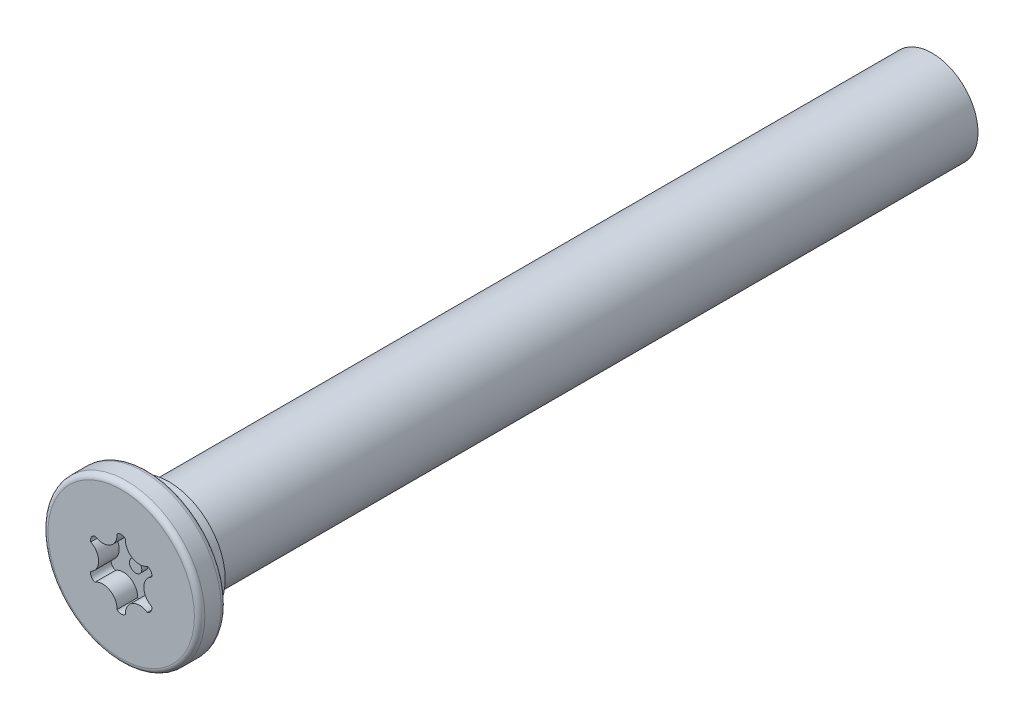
ISO-10303-21;
HEADER;
FILE_DESCRIPTION(('STEP AP214'),'2;1');
FILE_NAME('part.step','',(''),(''),'','','');
FILE_SCHEMA(('AUTOMOTIVE_DESIGN { 1 0 10303 214 1 1 1 1 }'));
ENDSEC;
DATA;
#1=APPLICATION_CONTEXT('core data for automotive mechanical design processes');
#2=APPLICATION_PROTOCOL_DEFINITION('international standard','automotive_design',2000,#1);
#3=PRODUCT_CONTEXT('',#1,'mechanical');
#4=PRODUCT('Part','Part','',(#3));
#5=PRODUCT_RELATED_PRODUCT_CATEGORY('part','',(#4));
#6=PRODUCT_DEFINITION_FORMATION('','',#4);
#7=PRODUCT_DEFINITION_CONTEXT('part definition',#1,'design');
#8=PRODUCT_DEFINITION('design','',#6,#7);
#9=PRODUCT_DEFINITION_SHAPE('','',#8);
#10=(LENGTH_UNIT() NAMED_UNIT(*) SI_UNIT(.MILLI.,.METRE.));
#11=(NAMED_UNIT(*) PLANE_ANGLE_UNIT() SI_UNIT($,.RADIAN.));
#12=(NAMED_UNIT(*) SI_UNIT($,.STERADIAN.) SOLID_ANGLE_UNIT());
#13=UNCERTAINTY_MEASURE_WITH_UNIT(LENGTH_MEASURE(1.E-05),#10,'distance_accuracy_value','');
#14=(GEOMETRIC_REPRESENTATION_CONTEXT(3) GLOBAL_UNCERTAINTY_ASSIGNED_CONTEXT((#13)) GLOBAL_UNIT_ASSIGNED_CONTEXT((#10,
#11,#12)) REPRESENTATION_CONTEXT('',''));
#15=CARTESIAN_POINT('',(0.,0.,0.));
#16=DIRECTION('',(0.,0.,1.));
#17=DIRECTION('',(1.,0.,0.));
#18=AXIS2_PLACEMENT_3D('',#15,#16,#17);
#19=CARTESIAN_POINT('',(0.,0.,0.));
#20=DIRECTION('',(0.,0.,1.));
#21=DIRECTION('',(1.,0.,0.));
#22=AXIS2_PLACEMENT_3D('',#19,#20,#21);
#23=PLANE('',#22);
#24=CARTESIAN_POINT('',(0.,0.,0.));
#25=DIRECTION('',(0.,0.,1.));
#26=DIRECTION('',(1.,0.,0.));
#27=AXIS2_PLACEMENT_3D('',#24,#25,#26);
#28=CIRCLE('',#27,3.55599999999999);
#29=CARTESIAN_POINT('',(3.55599999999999,0.,0.));
#30=VERTEX_POINT('',#29);
#31=EDGE_CURVE('E54',#30,#30,#28,.T.);
#32=ORIENTED_EDGE('',*,*,#31,.T.);
#33=EDGE_LOOP('',(#32));
#34=FACE_BOUND('',#33,.T.);
#35=CARTESIAN_POINT('',(0.893828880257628,1.54815703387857,0.));
#36=DIRECTION('',(0.,0.,1.));
#37=DIRECTION('',(1.,0.,0.));
#38=AXIS2_PLACEMENT_3D('',#35,#36,#37);
#39=CIRCLE('',#38,0.69);
#40=CARTESIAN_POINT('',(0.205060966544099,1.58937306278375,0.));
#41=VERTEX_POINT('',#40);
#42=CARTESIAN_POINT('',(1.27390696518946,0.972274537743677,0.));
#43=VERTEX_POINT('',#42);
#44=EDGE_CURVE('E181',#41,#43,#39,.T.);
#45=ORIENTED_EDGE('',*,*,#44,.T.);
#46=CARTESIAN_POINT('',(1.19884944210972,0.692156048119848,0.));
#47=DIRECTION('',(0.,0.,1.));
#48=DIRECTION('',(1.,0.,0.));
#49=AXIS2_PLACEMENT_3D('',#46,#47,#48);
#50=CIRCLE('',#49,0.29);
#51=CARTESIAN_POINT('',(1.47896793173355,0.617098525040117,0.));
#52=VERTEX_POINT('',#51);
#53=EDGE_CURVE('E61',#43,#52,#50,.F.);
#54=ORIENTED_EDGE('',*,*,#53,.T.);
#55=CARTESIAN_POINT('',(1.78765776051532,0.,0.));
#56=DIRECTION('',(0.,0.,1.));
#57=DIRECTION('',(1.,0.,0.));
#58=AXIS2_PLACEMENT_3D('',#55,#56,#57);
#59=CIRCLE('',#58,0.69);
#60=CARTESIAN_POINT('',(1.47896793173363,-0.617098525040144,0.));
#61=VERTEX_POINT('',#60);
#62=EDGE_CURVE('E111',#52,#61,#59,.T.);
#63=ORIENTED_EDGE('',*,*,#62,.T.);
#64=CARTESIAN_POINT('',(1.1988494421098,-0.692156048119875,0.));
#65=DIRECTION('',(0.,0.,1.));
#66=DIRECTION('',(1.,0.,0.));
#67=AXIS2_PLACEMENT_3D('',#64,#65,#66);
#68=CIRCLE('',#67,0.29);
#69=CARTESIAN_POINT('',(1.27390696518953,-0.972274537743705,0.));
#70=VERTEX_POINT('',#69);
#71=EDGE_CURVE('E216',#61,#70,#68,.F.);
#72=ORIENTED_EDGE('',*,*,#71,.T.);
#73=CARTESIAN_POINT('',(0.893828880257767,-1.54815703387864,0.));
#74=DIRECTION('',(0.,0.,1.));
#75=DIRECTION('',(1.,0.,0.));
#76=AXIS2_PLACEMENT_3D('',#73,#74,#75);
#77=CIRCLE('',#76,0.69);
#78=CARTESIAN_POINT('',(0.205060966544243,-1.5893730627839,0.));
#79=VERTEX_POINT('',#78);
#80=EDGE_CURVE('E160',#70,#79,#77,.T.);
#81=ORIENTED_EDGE('',*,*,#80,.T.);
#82=CARTESIAN_POINT('',(1.43067375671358E-13,-1.3843120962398,0.));
#83=DIRECTION('',(0.,0.,1.));
#84=DIRECTION('',(1.,0.,0.));
#85=AXIS2_PLACEMENT_3D('',#82,#83,#84);
#86=CIRCLE('',#85,0.29);
#87=CARTESIAN_POINT('',(-0.205060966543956,-1.5893730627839,0.));
#88=VERTEX_POINT('',#87);
#89=EDGE_CURVE('E210',#79,#88,#86,.F.);
#90=ORIENTED_EDGE('',*,*,#89,.T.);
#91=CARTESIAN_POINT('',(-0.893828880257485,-1.54815703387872,0.));
#92=DIRECTION('',(0.,0.,1.));
#93=DIRECTION('',(1.,0.,0.));
#94=AXIS2_PLACEMENT_3D('',#91,#92,#93);
#95=CIRCLE('',#94,0.69);
#96=CARTESIAN_POINT('',(-1.27390696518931,-0.97227453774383,0.));
#97=VERTEX_POINT('',#96);
#98=EDGE_CURVE('E206',#88,#97,#95,.T.);
#99=ORIENTED_EDGE('',*,*,#98,.T.);
#100=CARTESIAN_POINT('',(-1.19884944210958,-0.69215604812,0.));
#101=DIRECTION('',(0.,0.,1.));
#102=DIRECTION('',(1.,0.,0.));
#103=AXIS2_PLACEMENT_3D('',#100,#101,#102);
#104=CIRCLE('',#103,0.29);
#105=CARTESIAN_POINT('',(-1.47896793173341,-0.617098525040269,0.));
#106=VERTEX_POINT('',#105);
#107=EDGE_CURVE('E202',#97,#106,#104,.F.);
#108=ORIENTED_EDGE('',*,*,#107,.T.);
#109=CARTESIAN_POINT('',(-1.78765776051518,-1.56674837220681E-13,0.));
#110=DIRECTION('',(0.,0.,1.));
#111=DIRECTION('',(1.,0.,0.));
#112=AXIS2_PLACEMENT_3D('',#109,#110,#111);
#113=CIRCLE('',#112,0.69);
#114=CARTESIAN_POINT('',(-1.47896793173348,0.617098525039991,0.));
#115=VERTEX_POINT('',#114);
#116=EDGE_CURVE('E198',#106,#115,#113,.T.);
#117=ORIENTED_EDGE('',*,*,#116,.T.);
#118=CARTESIAN_POINT('',(-1.19884944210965,0.692156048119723,0.));
#119=DIRECTION('',(0.,0.,1.));
#120=DIRECTION('',(1.,0.,0.));
#121=AXIS2_PLACEMENT_3D('',#118,#119,#120);
#122=CIRCLE('',#121,0.29);
#123=CARTESIAN_POINT('',(-1.27390696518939,0.972274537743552,0.));
#124=VERTEX_POINT('',#123);
#125=EDGE_CURVE('E194',#115,#124,#122,.F.);
#126=ORIENTED_EDGE('',*,*,#125,.T.);
#127=CARTESIAN_POINT('',(-0.893828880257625,1.54815703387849,0.));
#128=DIRECTION('',(0.,0.,1.));
#129=DIRECTION('',(1.,0.,0.));
#130=AXIS2_PLACEMENT_3D('',#127,#128,#129);
#131=CIRCLE('',#130,0.690000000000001);
#132=CARTESIAN_POINT('',(-0.205060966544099,1.58937306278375,0.));
#133=VERTEX_POINT('',#132);
#134=EDGE_CURVE('E190',#124,#133,#131,.T.);
#135=ORIENTED_EDGE('',*,*,#134,.T.);
#136=CARTESIAN_POINT('',(0.,1.38431209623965,0.));
#137=DIRECTION('',(0.,0.,1.));
#138=DIRECTION('',(1.,0.,0.));
#139=AXIS2_PLACEMENT_3D('',#136,#137,#138);
#140=CIRCLE('',#139,0.29);
#141=EDGE_CURVE('E186',#133,#41,#140,.F.);
#142=ORIENTED_EDGE('',*,*,#141,.T.);
#143=EDGE_LOOP('',(#45,#54,#63,#72,#81,#90,#99,#108,#117,#126,#135,#142));
#144=FACE_BOUND('',#143,.T.);
#145=ADVANCED_FACE('F45',(#34,#144),#23,.T.);
#146=CARTESIAN_POINT('',(0.,0.,-1.3));
#147=DIRECTION('',(0.,0.,1.));
#148=DIRECTION('',(1.,0.,0.));
#149=AXIS2_PLACEMENT_3D('',#146,#147,#148);
#150=PLANE('',#149);
#151=CARTESIAN_POINT('',(0.,0.,-1.3));
#152=DIRECTION('',(0.,0.,1.));
#153=DIRECTION('',(1.,0.,0.));
#154=AXIS2_PLACEMENT_3D('',#151,#152,#153);
#155=CIRCLE('',#154,2.738000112);
#156=CARTESIAN_POINT('',(2.738000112,0.,-1.3));
#157=VERTEX_POINT('',#156);
#158=EDGE_CURVE('E11',#157,#157,#155,.F.);
#159=ORIENTED_EDGE('',*,*,#158,.F.);
#160=EDGE_LOOP('',(#159));
#161=FACE_BOUND('',#160,.T.);
#162=CARTESIAN_POINT('',(0.,0.,-1.3));
#163=DIRECTION('',(0.,0.,1.));
#164=DIRECTION('',(1.,0.,0.));
#165=AXIS2_PLACEMENT_3D('',#162,#163,#164);
#166=CIRCLE('',#165,3.55599999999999);
#167=CARTESIAN_POINT('',(3.55599999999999,0.,-1.3));
#168=VERTEX_POINT('',#167);
#169=EDGE_CURVE('E260',#168,#168,#166,.F.);
#170=ORIENTED_EDGE('',*,*,#169,.T.);
#171=EDGE_LOOP('',(#170));
#172=FACE_BOUND('',#171,.T.);
#173=ADVANCED_FACE('F283',(#161,#172),#150,.F.);
#174=CARTESIAN_POINT('',(0.,0.,-1.3));
#175=DIRECTION('',(0.,0.,1.));
#176=DIRECTION('',(1.,0.,0.));
#177=AXIS2_PLACEMENT_3D('',#174,#175,#176);
#178=CYLINDRICAL_SURFACE('',#177,3.80999999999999);
#179=CARTESIAN_POINT('',(0.,0.,-1.046));
#180=DIRECTION('',(0.,0.,1.));
#181=DIRECTION('',(1.,0.,0.));
#182=AXIS2_PLACEMENT_3D('',#179,#180,#181);
#183=CIRCLE('',#182,3.80999999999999);
#184=CARTESIAN_POINT('',(3.80999999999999,0.,-1.046));
#185=VERTEX_POINT('',#184);
#186=EDGE_CURVE('E256',#185,#185,#183,.T.);
#187=ORIENTED_EDGE('',*,*,#186,.T.);
#188=EDGE_LOOP('',(#187));
#189=FACE_BOUND('',#188,.T.);
#190=CARTESIAN_POINT('',(0.,0.,-0.254));
#191=DIRECTION('',(0.,0.,1.));
#192=DIRECTION('',(1.,0.,0.));
#193=AXIS2_PLACEMENT_3D('',#190,#191,#192);
#194=CIRCLE('',#193,3.80999999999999);
#195=CARTESIAN_POINT('',(3.80999999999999,0.,-0.254));
#196=VERTEX_POINT('',#195);
#197=EDGE_CURVE('E225',#196,#196,#194,.F.);
#198=ORIENTED_EDGE('',*,*,#197,.T.);
#199=EDGE_LOOP('',(#198));
#200=FACE_BOUND('',#199,.T.);
#201=ADVANCED_FACE('F289',(#189,#200),#178,.T.);
#202=CARTESIAN_POINT('',(1.19884944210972,0.692156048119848,-1.));
#203=DIRECTION('',(0.,0.,1.));
#204=DIRECTION('',(1.,0.,0.));
#205=AXIS2_PLACEMENT_3D('',#202,#203,#204);
#206=CYLINDRICAL_SURFACE('',#205,0.29);
#207=ORIENTED_EDGE('',*,*,#53,.F.);
#208=DIRECTION('',(0.,0.,1.));
#209=VECTOR('',#208,1.);
#210=CARTESIAN_POINT('',(1.27390696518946,0.972274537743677,-1.));
#211=LINE('',#210,#209);
#212=CARTESIAN_POINT('',(1.27390696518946,0.972274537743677,-1.));
#213=VERTEX_POINT('',#212);
#214=EDGE_CURVE('E178',#213,#43,#211,.T.);
#215=ORIENTED_EDGE('',*,*,#214,.F.);
#216=CARTESIAN_POINT('',(1.19884944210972,0.692156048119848,-1.));
#217=DIRECTION('',(0.,0.,1.));
#218=DIRECTION('',(1.,0.,0.));
#219=AXIS2_PLACEMENT_3D('',#216,#217,#218);
#220=CIRCLE('',#219,0.29);
#221=CARTESIAN_POINT('',(1.47896793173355,0.617098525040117,-1.));
#222=VERTEX_POINT('',#221);
#223=EDGE_CURVE('E221',#213,#222,#220,.F.);
#224=ORIENTED_EDGE('',*,*,#223,.T.);
#225=DIRECTION('',(0.,0.,1.));
#226=VECTOR('',#225,1.);
#227=CARTESIAN_POINT('',(1.47896793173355,0.617098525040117,-1.));
#228=LINE('',#227,#226);
#229=EDGE_CURVE('E222',#222,#52,#228,.T.);
#230=ORIENTED_EDGE('',*,*,#229,.T.);
#231=EDGE_LOOP('',(#207,#215,#224,#230));
#232=FACE_BOUND('',#231,.T.);
#233=ADVANCED_FACE('F294',(#232),#206,.F.);
#234=CARTESIAN_POINT('',(1.78765776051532,0.,-1.));
#235=DIRECTION('',(0.,0.,1.));
#236=DIRECTION('',(1.,0.,0.));
#237=AXIS2_PLACEMENT_3D('',#234,#235,#236);
#238=CYLINDRICAL_SURFACE('',#237,0.69);
#239=ORIENTED_EDGE('',*,*,#62,.F.);
#240=ORIENTED_EDGE('',*,*,#229,.F.);
#241=CARTESIAN_POINT('',(1.78765776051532,0.,-1.));
#242=DIRECTION('',(0.,0.,1.));
#243=DIRECTION('',(1.,0.,0.));
#244=AXIS2_PLACEMENT_3D('',#241,#242,#243);
#245=CIRCLE('',#244,0.69);
#246=CARTESIAN_POINT('',(1.47896793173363,-0.617098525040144,-1.));
#247=VERTEX_POINT('',#246);
#248=EDGE_CURVE('E70',#222,#247,#245,.T.);
#249=ORIENTED_EDGE('',*,*,#248,.T.);
#250=DIRECTION('',(0.,0.,1.));
#251=VECTOR('',#250,1.);
#252=CARTESIAN_POINT('',(1.47896793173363,-0.617098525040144,-1.));
#253=LINE('',#252,#251);
#254=EDGE_CURVE('E151',#247,#61,#253,.T.);
#255=ORIENTED_EDGE('',*,*,#254,.T.);
#256=EDGE_LOOP('',(#239,#240,#249,#255));
#257=FACE_BOUND('',#256,.T.);
#258=ADVANCED_FACE('F301',(#257),#238,.T.);
#259=CARTESIAN_POINT('',(1.1988494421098,-0.692156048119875,-1.));
#260=DIRECTION('',(0.,0.,1.));
#261=DIRECTION('',(1.,0.,0.));
#262=AXIS2_PLACEMENT_3D('',#259,#260,#261);
#263=CYLINDRICAL_SURFACE('',#262,0.29);
#264=ORIENTED_EDGE('',*,*,#71,.F.);
#265=ORIENTED_EDGE('',*,*,#254,.F.);
#266=CARTESIAN_POINT('',(1.1988494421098,-0.692156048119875,-1.));
#267=DIRECTION('',(0.,0.,1.));
#268=DIRECTION('',(1.,0.,0.));
#269=AXIS2_PLACEMENT_3D('',#266,#267,#268);
#270=CIRCLE('',#269,0.29);
#271=CARTESIAN_POINT('',(1.27390696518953,-0.972274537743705,-1.));
#272=VERTEX_POINT('',#271);
#273=EDGE_CURVE('E145',#247,#272,#270,.F.);
#274=ORIENTED_EDGE('',*,*,#273,.T.);
#275=DIRECTION('',(0.,0.,1.));
#276=VECTOR('',#275,1.);
#277=CARTESIAN_POINT('',(1.27390696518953,-0.972274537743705,-1.));
#278=LINE('',#277,#276);
#279=EDGE_CURVE('E149',#272,#70,#278,.T.);
#280=ORIENTED_EDGE('',*,*,#279,.T.);
#281=EDGE_LOOP('',(#264,#265,#274,#280));
#282=FACE_BOUND('',#281,.T.);
#283=ADVANCED_FACE('F148',(#282),#263,.F.);
#284=CARTESIAN_POINT('',(0.893828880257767,-1.54815703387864,-1.));
#285=DIRECTION('',(0.,0.,1.));
#286=DIRECTION('',(1.,0.,0.));
#287=AXIS2_PLACEMENT_3D('',#284,#285,#286);
#288=CYLINDRICAL_SURFACE('',#287,0.69);
#289=ORIENTED_EDGE('',*,*,#80,.F.);
#290=ORIENTED_EDGE('',*,*,#279,.F.);
#291=CARTESIAN_POINT('',(0.893828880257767,-1.54815703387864,-1.));
#292=DIRECTION('',(0.,0.,1.));
#293=DIRECTION('',(1.,0.,0.));
#294=AXIS2_PLACEMENT_3D('',#291,#292,#293);
#295=CIRCLE('',#294,0.69);
#296=CARTESIAN_POINT('',(0.205060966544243,-1.5893730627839,-1.));
#297=VERTEX_POINT('',#296);
#298=EDGE_CURVE('E154',#272,#297,#295,.T.);
#299=ORIENTED_EDGE('',*,*,#298,.T.);
#300=DIRECTION('',(0.,0.,1.));
#301=VECTOR('',#300,1.);
#302=CARTESIAN_POINT('',(0.205060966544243,-1.5893730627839,-1.));
#303=LINE('',#302,#301);
#304=EDGE_CURVE('E163',#297,#79,#303,.T.);
#305=ORIENTED_EDGE('',*,*,#304,.T.);
#306=EDGE_LOOP('',(#289,#290,#299,#305));
#307=FACE_BOUND('',#306,.T.);
#308=ADVANCED_FACE('F157',(#307),#288,.T.);
#309=CARTESIAN_POINT('',(1.43067375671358E-13,-1.3843120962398,-1.));
#310=DIRECTION('',(0.,0.,1.));
#311=DIRECTION('',(1.,0.,0.));
#312=AXIS2_PLACEMENT_3D('',#309,#310,#311);
#313=CYLINDRICAL_SURFACE('',#312,0.29);
#314=ORIENTED_EDGE('',*,*,#89,.F.);
#315=ORIENTED_EDGE('',*,*,#304,.F.);
#316=CARTESIAN_POINT('',(1.43067375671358E-13,-1.3843120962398,-1.));
#317=DIRECTION('',(0.,0.,1.));
#318=DIRECTION('',(1.,0.,0.));
#319=AXIS2_PLACEMENT_3D('',#316,#317,#318);
#320=CIRCLE('',#319,0.29);
#321=CARTESIAN_POINT('',(-0.205060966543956,-1.5893730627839,-1.));
#322=VERTEX_POINT('',#321);
#323=EDGE_CURVE('E168',#297,#322,#320,.F.);
#324=ORIENTED_EDGE('',*,*,#323,.T.);
#325=DIRECTION('',(0.,0.,1.));
#326=VECTOR('',#325,1.);
#327=CARTESIAN_POINT('',(-0.205060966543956,-1.5893730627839,-1.));
#328=LINE('',#327,#326);
#329=EDGE_CURVE('E230',#322,#88,#328,.T.);
#330=ORIENTED_EDGE('',*,*,#329,.T.);
#331=EDGE_LOOP('',(#314,#315,#324,#330));
#332=FACE_BOUND('',#331,.T.);
#333=ADVANCED_FACE('F318',(#332),#313,.F.);
#334=CARTESIAN_POINT('',(-0.893828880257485,-1.54815703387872,-1.));
#335=DIRECTION('',(0.,0.,1.));
#336=DIRECTION('',(1.,0.,0.));
#337=AXIS2_PLACEMENT_3D('',#334,#335,#336);
#338=CYLINDRICAL_SURFACE('',#337,0.69);
#339=ORIENTED_EDGE('',*,*,#98,.F.);
#340=ORIENTED_EDGE('',*,*,#329,.F.);
#341=CARTESIAN_POINT('',(-0.893828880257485,-1.54815703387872,-1.));
#342=DIRECTION('',(0.,0.,1.));
#343=DIRECTION('',(1.,0.,0.));
#344=AXIS2_PLACEMENT_3D('',#341,#342,#343);
#345=CIRCLE('',#344,0.69);
#346=CARTESIAN_POINT('',(-1.27390696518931,-0.97227453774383,-1.));
#347=VERTEX_POINT('',#346);
#348=EDGE_CURVE('E172',#322,#347,#345,.T.);
#349=ORIENTED_EDGE('',*,*,#348,.T.);
#350=DIRECTION('',(0.,0.,1.));
#351=VECTOR('',#350,1.);
#352=CARTESIAN_POINT('',(-1.27390696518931,-0.97227453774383,-1.));
#353=LINE('',#352,#351);
#354=EDGE_CURVE('E233',#347,#97,#353,.T.);
#355=ORIENTED_EDGE('',*,*,#354,.T.);
#356=EDGE_LOOP('',(#339,#340,#349,#355));
#357=FACE_BOUND('',#356,.T.);
#358=ADVANCED_FACE('F321',(#357),#338,.T.);
#359=CARTESIAN_POINT('',(-1.19884944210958,-0.69215604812,-1.));
#360=DIRECTION('',(0.,0.,1.));
#361=DIRECTION('',(1.,0.,0.));
#362=AXIS2_PLACEMENT_3D('',#359,#360,#361);
#363=CYLINDRICAL_SURFACE('',#362,0.29);
#364=ORIENTED_EDGE('',*,*,#107,.F.);
#365=ORIENTED_EDGE('',*,*,#354,.F.);
#366=CARTESIAN_POINT('',(-1.19884944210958,-0.69215604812,-1.));
#367=DIRECTION('',(0.,0.,1.));
#368=DIRECTION('',(1.,0.,0.));
#369=AXIS2_PLACEMENT_3D('',#366,#367,#368);
#370=CIRCLE('',#369,0.29);
#371=CARTESIAN_POINT('',(-1.47896793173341,-0.617098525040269,-1.));
#372=VERTEX_POINT('',#371);
#373=EDGE_CURVE('E374',#347,#372,#370,.F.);
#374=ORIENTED_EDGE('',*,*,#373,.T.);
#375=DIRECTION('',(0.,0.,1.));
#376=VECTOR('',#375,1.);
#377=CARTESIAN_POINT('',(-1.47896793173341,-0.617098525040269,-1.));
#378=LINE('',#377,#376);
#379=EDGE_CURVE('E236',#372,#106,#378,.T.);
#380=ORIENTED_EDGE('',*,*,#379,.T.);
#381=EDGE_LOOP('',(#364,#365,#374,#380));
#382=FACE_BOUND('',#381,.T.);
#383=ADVANCED_FACE('F325',(#382),#363,.F.);
#384=CARTESIAN_POINT('',(-1.78765776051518,-1.56674837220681E-13,-1.));
#385=DIRECTION('',(0.,0.,1.));
#386=DIRECTION('',(1.,0.,0.));
#387=AXIS2_PLACEMENT_3D('',#384,#385,#386);
#388=CYLINDRICAL_SURFACE('',#387,0.69);
#389=ORIENTED_EDGE('',*,*,#116,.F.);
#390=ORIENTED_EDGE('',*,*,#379,.F.);
#391=CARTESIAN_POINT('',(-1.78765776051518,-1.56674837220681E-13,-1.));
#392=DIRECTION('',(0.,0.,1.));
#393=DIRECTION('',(1.,0.,0.));
#394=AXIS2_PLACEMENT_3D('',#391,#392,#393);
#395=CIRCLE('',#394,0.69);
#396=CARTESIAN_POINT('',(-1.47896793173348,0.617098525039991,-1.));
#397=VERTEX_POINT('',#396);
#398=EDGE_CURVE('E371',#372,#397,#395,.T.);
#399=ORIENTED_EDGE('',*,*,#398,.T.);
#400=DIRECTION('',(0.,0.,1.));
#401=VECTOR('',#400,1.);
#402=CARTESIAN_POINT('',(-1.47896793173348,0.617098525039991,-1.));
#403=LINE('',#402,#401);
#404=EDGE_CURVE('E239',#397,#115,#403,.T.);
#405=ORIENTED_EDGE('',*,*,#404,.T.);
#406=EDGE_LOOP('',(#389,#390,#399,#405));
#407=FACE_BOUND('',#406,.T.);
#408=ADVANCED_FACE('F329',(#407),#388,.T.);
#409=CARTESIAN_POINT('',(-1.19884944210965,0.692156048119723,-1.));
#410=DIRECTION('',(0.,0.,1.));
#411=DIRECTION('',(1.,0.,0.));
#412=AXIS2_PLACEMENT_3D('',#409,#410,#411);
#413=CYLINDRICAL_SURFACE('',#412,0.29);
#414=ORIENTED_EDGE('',*,*,#125,.F.);
#415=ORIENTED_EDGE('',*,*,#404,.F.);
#416=CARTESIAN_POINT('',(-1.19884944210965,0.692156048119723,-1.));
#417=DIRECTION('',(0.,0.,1.));
#418=DIRECTION('',(1.,0.,0.));
#419=AXIS2_PLACEMENT_3D('',#416,#417,#418);
#420=CIRCLE('',#419,0.29);
#421=CARTESIAN_POINT('',(-1.27390696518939,0.972274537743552,-1.));
#422=VERTEX_POINT('',#421);
#423=EDGE_CURVE('E364',#397,#422,#420,.F.);
#424=ORIENTED_EDGE('',*,*,#423,.T.);
#425=DIRECTION('',(0.,0.,1.));
#426=VECTOR('',#425,1.);
#427=CARTESIAN_POINT('',(-1.27390696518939,0.972274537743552,-1.));
#428=LINE('',#427,#426);
#429=EDGE_CURVE('E242',#422,#124,#428,.T.);
#430=ORIENTED_EDGE('',*,*,#429,.T.);
#431=EDGE_LOOP('',(#414,#415,#424,#430));
#432=FACE_BOUND('',#431,.T.);
#433=ADVANCED_FACE('F333',(#432),#413,.F.);
#434=CARTESIAN_POINT('',(-0.893828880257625,1.54815703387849,-1.));
#435=DIRECTION('',(0.,0.,1.));
#436=DIRECTION('',(1.,0.,0.));
#437=AXIS2_PLACEMENT_3D('',#434,#435,#436);
#438=CYLINDRICAL_SURFACE('',#437,0.690000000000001);
#439=ORIENTED_EDGE('',*,*,#134,.F.);
#440=ORIENTED_EDGE('',*,*,#429,.F.);
#441=CARTESIAN_POINT('',(-0.893828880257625,1.54815703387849,-1.));
#442=DIRECTION('',(0.,0.,1.));
#443=DIRECTION('',(1.,0.,0.));
#444=AXIS2_PLACEMENT_3D('',#441,#442,#443);
#445=CIRCLE('',#444,0.690000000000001);
#446=CARTESIAN_POINT('',(-0.205060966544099,1.58937306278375,-1.));
#447=VERTEX_POINT('',#446);
#448=EDGE_CURVE('E360',#422,#447,#445,.T.);
#449=ORIENTED_EDGE('',*,*,#448,.T.);
#450=DIRECTION('',(0.,0.,1.));
#451=VECTOR('',#450,1.);
#452=CARTESIAN_POINT('',(-0.205060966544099,1.58937306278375,-1.));
#453=LINE('',#452,#451);
#454=EDGE_CURVE('E245',#447,#133,#453,.T.);
#455=ORIENTED_EDGE('',*,*,#454,.T.);
#456=EDGE_LOOP('',(#439,#440,#449,#455));
#457=FACE_BOUND('',#456,.T.);
#458=ADVANCED_FACE('F337',(#457),#438,.T.);
#459=CARTESIAN_POINT('',(0.,1.38431209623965,-1.));
#460=DIRECTION('',(0.,0.,1.));
#461=DIRECTION('',(1.,0.,0.));
#462=AXIS2_PLACEMENT_3D('',#459,#460,#461);
#463=CYLINDRICAL_SURFACE('',#462,0.29);
#464=ORIENTED_EDGE('',*,*,#141,.F.);
#465=ORIENTED_EDGE('',*,*,#454,.F.);
#466=CARTESIAN_POINT('',(0.,1.38431209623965,-1.));
#467=DIRECTION('',(0.,0.,1.));
#468=DIRECTION('',(1.,0.,0.));
#469=AXIS2_PLACEMENT_3D('',#466,#467,#468);
#470=CIRCLE('',#469,0.29);
#471=CARTESIAN_POINT('',(0.205060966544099,1.58937306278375,-1.));
#472=VERTEX_POINT('',#471);
#473=EDGE_CURVE('E357',#447,#472,#470,.F.);
#474=ORIENTED_EDGE('',*,*,#473,.T.);
#475=DIRECTION('',(0.,0.,1.));
#476=VECTOR('',#475,1.);
#477=CARTESIAN_POINT('',(0.205060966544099,1.58937306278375,-1.));
#478=LINE('',#477,#476);
#479=EDGE_CURVE('E248',#472,#41,#478,.T.);
#480=ORIENTED_EDGE('',*,*,#479,.T.);
#481=EDGE_LOOP('',(#464,#465,#474,#480));
#482=FACE_BOUND('',#481,.T.);
#483=ADVANCED_FACE('F341',(#482),#463,.F.);
#484=CARTESIAN_POINT('',(0.893828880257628,1.54815703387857,-1.));
#485=DIRECTION('',(0.,0.,1.));
#486=DIRECTION('',(1.,0.,0.));
#487=AXIS2_PLACEMENT_3D('',#484,#485,#486);
#488=CYLINDRICAL_SURFACE('',#487,0.69);
#489=ORIENTED_EDGE('',*,*,#44,.F.);
#490=ORIENTED_EDGE('',*,*,#479,.F.);
#491=CARTESIAN_POINT('',(0.893828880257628,1.54815703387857,-1.));
#492=DIRECTION('',(0.,0.,1.));
#493=DIRECTION('',(1.,0.,0.));
#494=AXIS2_PLACEMENT_3D('',#491,#492,#493);
#495=CIRCLE('',#494,0.69);
#496=EDGE_CURVE('E118',#472,#213,#495,.T.);
#497=ORIENTED_EDGE('',*,*,#496,.T.);
#498=ORIENTED_EDGE('',*,*,#214,.T.);
#499=EDGE_LOOP('',(#489,#490,#497,#498));
#500=FACE_BOUND('',#499,.T.);
#501=ADVANCED_FACE('F344',(#500),#488,.T.);
#502=CARTESIAN_POINT('',(0.,0.,-1.));
#503=DIRECTION('',(0.,0.,1.));
#504=DIRECTION('',(1.,0.,0.));
#505=AXIS2_PLACEMENT_3D('',#502,#503,#504);
#506=PLANE('',#505);
#507=CARTESIAN_POINT('',(0.,0.,-1.));
#508=DIRECTION('',(0.,0.,1.));
#509=DIRECTION('',(1.,0.,0.));
#510=AXIS2_PLACEMENT_3D('',#507,#508,#509);
#511=CIRCLE('',#510,0.3);
#512=CARTESIAN_POINT('',(0.3,0.,-1.));
#513=VERTEX_POINT('',#512);
#514=EDGE_CURVE('E396',#513,#513,#511,.T.);
#515=ORIENTED_EDGE('',*,*,#514,.F.);
#516=EDGE_LOOP('',(#515));
#517=FACE_BOUND('',#516,.T.);
#518=ORIENTED_EDGE('',*,*,#223,.F.);
#519=ORIENTED_EDGE('',*,*,#496,.F.);
#520=ORIENTED_EDGE('',*,*,#473,.F.);
#521=ORIENTED_EDGE('',*,*,#448,.F.);
#522=ORIENTED_EDGE('',*,*,#423,.F.);
#523=ORIENTED_EDGE('',*,*,#398,.F.);
#524=ORIENTED_EDGE('',*,*,#373,.F.);
#525=ORIENTED_EDGE('',*,*,#348,.F.);
#526=ORIENTED_EDGE('',*,*,#323,.F.);
#527=ORIENTED_EDGE('',*,*,#298,.F.);
#528=ORIENTED_EDGE('',*,*,#273,.F.);
#529=ORIENTED_EDGE('',*,*,#248,.F.);
#530=EDGE_LOOP('',(#518,#519,#520,#521,#522,#523,#524,#525,#526,#527,#528,#529));
#531=FACE_BOUND('',#530,.T.);
#532=ADVANCED_FACE('F166',(#517,#531),#506,.T.);
#533=CARTESIAN_POINT('',(0.,0.,-1.046));
#534=DIRECTION('',(0.,0.,1.));
#535=DIRECTION('',(1.,0.,0.));
#536=AXIS2_PLACEMENT_3D('',#533,#534,#535);
#537=TOROIDAL_SURFACE('',#536,3.55599999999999,0.254);
#538=ORIENTED_EDGE('',*,*,#169,.F.);
#539=EDGE_LOOP('',(#538));
#540=FACE_BOUND('',#539,.T.);
#541=ORIENTED_EDGE('',*,*,#186,.F.);
#542=EDGE_LOOP('',(#541));
#543=FACE_BOUND('',#542,.T.);
#544=ADVANCED_FACE('F271',(#540,#543),#537,.T.);
#545=CARTESIAN_POINT('',(0.,0.,-0.254));
#546=DIRECTION('',(0.,0.,1.));
#547=DIRECTION('',(1.,0.,0.));
#548=AXIS2_PLACEMENT_3D('',#545,#546,#547);
#549=TOROIDAL_SURFACE('',#548,3.55599999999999,0.254);
#550=ORIENTED_EDGE('',*,*,#197,.F.);
#551=EDGE_LOOP('',(#550));
#552=FACE_BOUND('',#551,.T.);
#553=ORIENTED_EDGE('',*,*,#31,.F.);
#554=EDGE_LOOP('',(#553));
#555=FACE_BOUND('',#554,.T.);
#556=ADVANCED_FACE('F47',(#552,#555),#549,.T.);
#557=CARTESIAN_POINT('',(0.,0.,-2.316));
#558=DIRECTION('',(0.,0.,-1.));
#559=DIRECTION('',(-1.,0.,0.));
#560=AXIS2_PLACEMENT_3D('',#557,#558,#559);
#561=PLANE('',#560);
#562=CARTESIAN_POINT('',(0.,0.,-2.316));
#563=DIRECTION('',(0.,0.,-1.));
#564=DIRECTION('',(-1.,0.,0.));
#565=AXIS2_PLACEMENT_3D('',#562,#563,#564);
#566=CIRCLE('',#565,2.738000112);
#567=CARTESIAN_POINT('',(-2.738000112,0.,-2.316));
#568=VERTEX_POINT('',#567);
#569=EDGE_CURVE('E182',#568,#568,#566,.T.);
#570=ORIENTED_EDGE('',*,*,#569,.T.);
#571=EDGE_LOOP('',(#570));
#572=FACE_BOUND('',#571,.T.);
#573=CARTESIAN_POINT('',(0.,0.,-2.316));
#574=DIRECTION('',(0.,0.,-1.));
#575=DIRECTION('',(-1.,0.,0.));
#576=AXIS2_PLACEMENT_3D('',#573,#574,#575);
#577=CIRCLE('',#576,2.230000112);
#578=CARTESIAN_POINT('',(2.230000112,0.,-2.31600000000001));
#579=VERTEX_POINT('',#578);
#580=EDGE_CURVE('E400',#579,#579,#577,.T.);
#581=ORIENTED_EDGE('',*,*,#580,.F.);
#582=EDGE_LOOP('',(#581));
#583=FACE_BOUND('',#582,.T.);
#584=ADVANCED_FACE('F270',(#572,#583),#561,.T.);
#585=CARTESIAN_POINT('',(0.,0.,-2.316));
#586=DIRECTION('',(0.,0.,1.));
#587=DIRECTION('',(1.,0.,0.));
#588=AXIS2_PLACEMENT_3D('',#585,#586,#587);
#589=CYLINDRICAL_SURFACE('',#588,2.738000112);
#590=ORIENTED_EDGE('',*,*,#569,.F.);
#591=EDGE_LOOP('',(#590));
#592=FACE_BOUND('',#591,.T.);
#593=ORIENTED_EDGE('',*,*,#158,.T.);
#594=EDGE_LOOP('',(#593));
#595=FACE_BOUND('',#594,.T.);
#596=ADVANCED_FACE('F277',(#592,#595),#589,.T.);
#597=CARTESIAN_POINT('',(0.,0.,-0.7));
#598=DIRECTION('',(0.,0.,-1.));
#599=DIRECTION('',(-1.,0.,0.));
#600=AXIS2_PLACEMENT_3D('',#597,#598,#599);
#601=CYLINDRICAL_SURFACE('',#600,0.3);
#602=CARTESIAN_POINT('',(0.,0.,-0.7));
#603=DIRECTION('',(0.,0.,1.));
#604=DIRECTION('',(1.,0.,0.));
#605=AXIS2_PLACEMENT_3D('',#602,#603,#604);
#606=CIRCLE('',#605,0.3);
#607=CARTESIAN_POINT('',(0.3,0.,-0.7));
#608=VERTEX_POINT('',#607);
#609=EDGE_CURVE('E395',#608,#608,#606,.T.);
#610=ORIENTED_EDGE('',*,*,#609,.F.);
#611=EDGE_LOOP('',(#610));
#612=FACE_BOUND('',#611,.T.);
#613=ORIENTED_EDGE('',*,*,#514,.T.);
#614=EDGE_LOOP('',(#613));
#615=FACE_BOUND('',#614,.T.);
#616=ADVANCED_FACE('F424',(#612,#615),#601,.T.);
#617=CARTESIAN_POINT('',(0.,0.,-0.7));
#618=DIRECTION('',(0.,0.,1.));
#619=DIRECTION('',(1.,0.,0.));
#620=AXIS2_PLACEMENT_3D('',#617,#618,#619);
#621=PLANE('',#620);
#622=ORIENTED_EDGE('',*,*,#609,.T.);
#623=EDGE_LOOP('',(#622));
#624=FACE_BOUND('',#623,.T.);
#625=ADVANCED_FACE('F416',(#624),#621,.T.);
#626=CARTESIAN_POINT('',(0.,0.,-39.4));
#627=DIRECTION('',(0.,0.,1.));
#628=DIRECTION('',(1.,0.,0.));
#629=AXIS2_PLACEMENT_3D('',#626,#627,#628);
#630=CYLINDRICAL_SURFACE('',#629,2.230000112);
#631=CARTESIAN_POINT('',(0.,0.,-39.4));
#632=DIRECTION('',(0.,0.,-1.));
#633=DIRECTION('',(-1.,0.,0.));
#634=AXIS2_PLACEMENT_3D('',#631,#632,#633);
#635=CIRCLE('',#634,2.230000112);
#636=CARTESIAN_POINT('',(2.230000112,0.,-39.4));
#637=VERTEX_POINT('',#636);
#638=EDGE_CURVE('E407',#637,#637,#635,.T.);
#639=CARTESIAN_POINT('',(2.230000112,0.,-2.31600000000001));
#640=CARTESIAN_POINT('',(2.230000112,0.,-2.70229166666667));
#641=CARTESIAN_POINT('',(2.230000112,0.,-3.08858333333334));
#642=CARTESIAN_POINT('',(2.230000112,0.,-3.86116666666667));
#643=CARTESIAN_POINT('',(2.230000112,0.,-4.24745833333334));
#644=CARTESIAN_POINT('',(2.230000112,0.,-5.02004166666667));
#645=CARTESIAN_POINT('',(2.230000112,0.,-5.40633333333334));
#646=CARTESIAN_POINT('',(2.230000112,0.,-6.17891666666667));
#647=CARTESIAN_POINT('',(2.230000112,0.,-6.56520833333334));
#648=CARTESIAN_POINT('',(2.230000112,0.,-7.33779166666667));
#649=CARTESIAN_POINT('',(2.230000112,0.,-7.72408333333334));
#650=CARTESIAN_POINT('',(2.230000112,0.,-8.49666666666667));
#651=CARTESIAN_POINT('',(2.230000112,0.,-8.88295833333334));
#652=CARTESIAN_POINT('',(2.230000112,0.,-9.65554166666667));
#653=CARTESIAN_POINT('',(2.230000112,0.,-10.0418333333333));
#654=CARTESIAN_POINT('',(2.230000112,0.,-10.8144166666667));
#655=CARTESIAN_POINT('',(2.230000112,0.,-11.2007083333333));
#656=CARTESIAN_POINT('',(2.230000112,0.,-11.9732916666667));
#657=CARTESIAN_POINT('',(2.230000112,0.,-12.3595833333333));
#658=CARTESIAN_POINT('',(2.230000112,0.,-13.1321666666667));
#659=CARTESIAN_POINT('',(2.230000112,0.,-13.5184583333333));
#660=CARTESIAN_POINT('',(2.230000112,0.,-14.2910416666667));
#661=CARTESIAN_POINT('',(2.230000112,0.,-14.6773333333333));
#662=CARTESIAN_POINT('',(2.230000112,0.,-15.4499166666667));
#663=CARTESIAN_POINT('',(2.230000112,0.,-15.8362083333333));
#664=CARTESIAN_POINT('',(2.230000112,0.,-16.6087916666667));
#665=CARTESIAN_POINT('',(2.230000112,0.,-16.9950833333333));
#666=CARTESIAN_POINT('',(2.230000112,0.,-17.7676666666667));
#667=CARTESIAN_POINT('',(2.230000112,0.,-18.1539583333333));
#668=CARTESIAN_POINT('',(2.230000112,0.,-18.9265416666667));
#669=CARTESIAN_POINT('',(2.230000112,0.,-19.3128333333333));
#670=CARTESIAN_POINT('',(2.230000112,0.,-20.0854166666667));
#671=CARTESIAN_POINT('',(2.230000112,0.,-20.4717083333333));
#672=CARTESIAN_POINT('',(2.230000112,0.,-21.2442916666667));
#673=CARTESIAN_POINT('',(2.230000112,0.,-21.6305833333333));
#674=CARTESIAN_POINT('',(2.230000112,0.,-22.4031666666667));
#675=CARTESIAN_POINT('',(2.230000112,0.,-22.7894583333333));
#676=CARTESIAN_POINT('',(2.230000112,0.,-23.5620416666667));
#677=CARTESIAN_POINT('',(2.230000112,0.,-23.9483333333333));
#678=CARTESIAN_POINT('',(2.230000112,0.,-24.7209166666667));
#679=CARTESIAN_POINT('',(2.230000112,0.,-25.1072083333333));
#680=CARTESIAN_POINT('',(2.230000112,0.,-25.8797916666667));
#681=CARTESIAN_POINT('',(2.230000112,0.,-26.2660833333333));
#682=CARTESIAN_POINT('',(2.230000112,0.,-27.0386666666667));
#683=CARTESIAN_POINT('',(2.230000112,0.,-27.4249583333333));
#684=CARTESIAN_POINT('',(2.230000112,0.,-28.1975416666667));
#685=CARTESIAN_POINT('',(2.230000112,0.,-28.5838333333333));
#686=CARTESIAN_POINT('',(2.230000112,0.,-29.3564166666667));
#687=CARTESIAN_POINT('',(2.230000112,0.,-29.7427083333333));
#688=CARTESIAN_POINT('',(2.230000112,0.,-30.5152916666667));
#689=CARTESIAN_POINT('',(2.230000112,0.,-30.9015833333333));
#690=CARTESIAN_POINT('',(2.230000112,0.,-31.6741666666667));
#691=CARTESIAN_POINT('',(2.230000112,0.,-32.0604583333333));
#692=CARTESIAN_POINT('',(2.230000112,0.,-32.8330416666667));
#693=CARTESIAN_POINT('',(2.230000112,0.,-33.2193333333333));
#694=CARTESIAN_POINT('',(2.230000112,0.,-33.9919166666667));
#695=CARTESIAN_POINT('',(2.230000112,0.,-34.3782083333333));
#696=CARTESIAN_POINT('',(2.230000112,0.,-35.1507916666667));
#697=CARTESIAN_POINT('',(2.230000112,0.,-35.5370833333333));
#698=CARTESIAN_POINT('',(2.230000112,0.,-36.3096666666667));
#699=CARTESIAN_POINT('',(2.230000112,0.,-36.6959583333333));
#700=CARTESIAN_POINT('',(2.230000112,0.,-37.4685416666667));
#701=CARTESIAN_POINT('',(2.230000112,0.,-37.8548333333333));
#702=CARTESIAN_POINT('',(2.230000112,0.,-38.6274166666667));
#703=CARTESIAN_POINT('',(2.230000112,0.,-39.0137083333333));
#704=CARTESIAN_POINT('',(2.230000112,0.,-39.4));
#705=B_SPLINE_CURVE_WITH_KNOTS('',3,(#639,#640,#641,#642,#643,#644,#645,#646,#647,#648,#649,
#650,#651,#652,#653,#654,#655,#656,#657,#658,#659,#660,#661,#662,#663,#664,#665,#666,#667,#668,
#669,#670,#671,#672,#673,#674,#675,#676,#677,#678,#679,#680,#681,#682,#683,#684,#685,#686,#687,
#688,#689,#690,#691,#692,#693,#694,#695,#696,#697,#698,#699,#700,#701,#702,#703,#704),
.UNSPECIFIED.,.F.,.F.,(4,2,2,2,2,2,2,2,2,2,2,2,2,2,2,2,2,2,2,2,2,2,2,2,2,2,2,2,2,2,2,2,4),(0.,
1.158875,2.31775,3.476625,4.6355,5.794375,6.95325,8.11212499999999,9.271,10.429875,11.58875,
12.747625,13.9065,15.065375,16.22425,17.383125,18.542,19.700875,20.85975,22.018625,23.1775,
24.336375,25.49525,26.654125,27.813,28.971875,30.13075,31.289625,32.4485,33.607375,34.76625,
35.925125,37.084),.UNSPECIFIED.);
#706=EDGE_CURVE('BSEAM414',#579,#637,#705,.T.);
#707=ORIENTED_EDGE('',*,*,#580,.T.);
#708=ORIENTED_EDGE('',*,*,#638,.F.);
#709=ORIENTED_EDGE('',*,*,#706,.T.);
#710=ORIENTED_EDGE('',*,*,#706,.F.);
#711=EDGE_LOOP('',(#707,#709,#708,#710));
#712=FACE_BOUND('',#711,.T.);
#713=ADVANCED_FACE('F414',(#712),#630,.T.);
#714=CARTESIAN_POINT('',(0.,0.,-39.4));
#715=DIRECTION('',(0.,0.,-1.));
#716=DIRECTION('',(-1.,0.,0.));
#717=AXIS2_PLACEMENT_3D('',#714,#715,#716);
#718=PLANE('',#717);
#719=ORIENTED_EDGE('',*,*,#638,.T.);
#720=EDGE_LOOP('',(#719));
#721=FACE_BOUND('',#720,.T.);
#722=ADVANCED_FACE('F412',(#721),#718,.T.);
#723=CLOSED_SHELL('',(#145,#173,#201,#233,#258,#283,#308,#333,#358,#383,#408,#433,#458,#483,
#501,#532,#544,#556,#584,#596,#616,#625,#713,#722));
#724=MANIFOLD_SOLID_BREP('B2',#723);
#725=ADVANCED_BREP_SHAPE_REPRESENTATION('',(#18,#724),#14);
#726=SHAPE_DEFINITION_REPRESENTATION(#9,#725);
ENDSEC;
END-ISO-10303-21;
